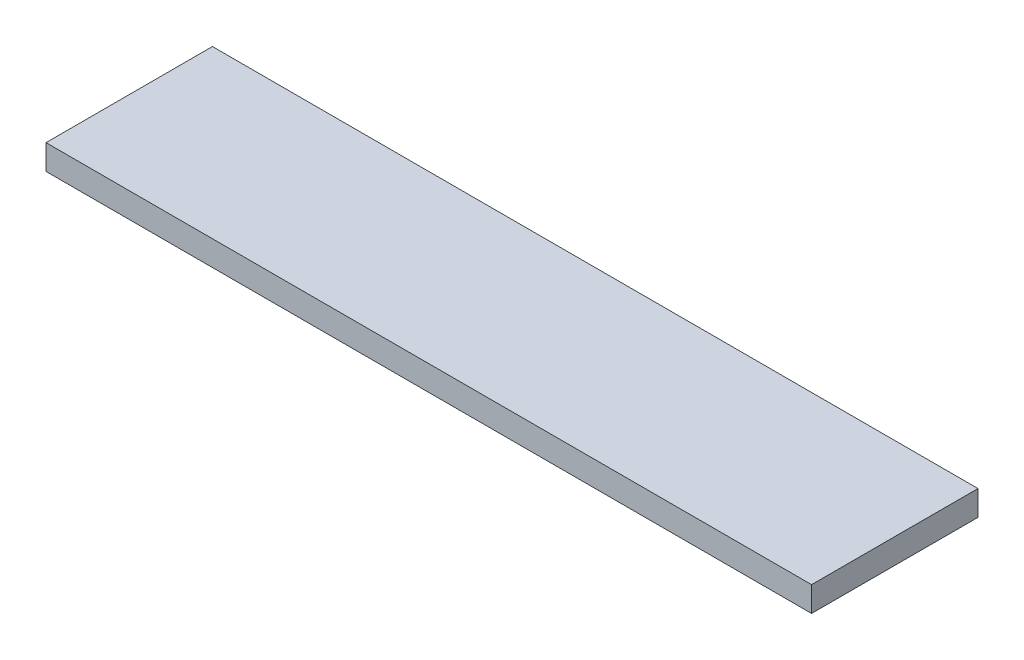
ISO-10303-21;
HEADER;
FILE_DESCRIPTION(('STEP AP214'),'2;1');
FILE_NAME('part.step','',(''),(''),'','','');
FILE_SCHEMA(('AUTOMOTIVE_DESIGN { 1 0 10303 214 1 1 1 1 }'));
ENDSEC;
DATA;
#1=APPLICATION_CONTEXT('core data for automotive mechanical design processes');
#2=APPLICATION_PROTOCOL_DEFINITION('international standard','automotive_design',2000,#1);
#3=PRODUCT_CONTEXT('',#1,'mechanical');
#4=PRODUCT('Part','Part','',(#3));
#5=PRODUCT_RELATED_PRODUCT_CATEGORY('part','',(#4));
#6=PRODUCT_DEFINITION_FORMATION('','',#4);
#7=PRODUCT_DEFINITION_CONTEXT('part definition',#1,'design');
#8=PRODUCT_DEFINITION('design','',#6,#7);
#9=PRODUCT_DEFINITION_SHAPE('','',#8);
#10=(LENGTH_UNIT() NAMED_UNIT(*) SI_UNIT(.MILLI.,.METRE.));
#11=(NAMED_UNIT(*) PLANE_ANGLE_UNIT() SI_UNIT($,.RADIAN.));
#12=(NAMED_UNIT(*) SI_UNIT($,.STERADIAN.) SOLID_ANGLE_UNIT());
#13=UNCERTAINTY_MEASURE_WITH_UNIT(LENGTH_MEASURE(1.E-05),#10,'distance_accuracy_value','');
#14=(GEOMETRIC_REPRESENTATION_CONTEXT(3) GLOBAL_UNCERTAINTY_ASSIGNED_CONTEXT((#13)) GLOBAL_UNIT_ASSIGNED_CONTEXT((#10,
#11,#12)) REPRESENTATION_CONTEXT('',''));
#15=CARTESIAN_POINT('',(0.,0.,0.));
#16=DIRECTION('',(0.,0.,1.));
#17=DIRECTION('',(1.,0.,0.));
#18=AXIS2_PLACEMENT_3D('',#15,#16,#17);
#19=CARTESIAN_POINT('',(41.5,-0.01,15.));
#20=DIRECTION('',(-1.,0.,0.));
#21=DIRECTION('',(0.,0.,1.));
#22=AXIS2_PLACEMENT_3D('',#19,#20,#21);
#23=PLANE('',#22);
#24=DIRECTION('',(0.,1.,0.));
#25=VECTOR('',#24,1.);
#26=CARTESIAN_POINT('',(41.5,-0.01,5.));
#27=LINE('',#26,#25);
#28=CARTESIAN_POINT('',(41.5,0.,5.));
#29=VERTEX_POINT('',#28);
#30=CARTESIAN_POINT('',(41.5,1.5,5.));
#31=VERTEX_POINT('',#30);
#32=EDGE_CURVE('E39',#29,#31,#27,.T.);
#33=ORIENTED_EDGE('',*,*,#32,.T.);
#34=DIRECTION('',(0.,0.,1.));
#35=VECTOR('',#34,1.);
#36=CARTESIAN_POINT('',(41.5,1.5,0.));
#37=LINE('',#36,#35);
#38=CARTESIAN_POINT('',(41.5,1.5,15.));
#39=VERTEX_POINT('',#38);
#40=EDGE_CURVE('E90',#31,#39,#37,.T.);
#41=ORIENTED_EDGE('',*,*,#40,.T.);
#42=DIRECTION('',(0.,1.,0.));
#43=VECTOR('',#42,1.);
#44=CARTESIAN_POINT('',(41.5,1.5,15.));
#45=LINE('',#44,#43);
#46=CARTESIAN_POINT('',(41.5,0.,15.));
#47=VERTEX_POINT('',#46);
#48=EDGE_CURVE('E89',#47,#39,#45,.T.);
#49=ORIENTED_EDGE('',*,*,#48,.F.);
#50=DIRECTION('',(0.,0.,1.));
#51=VECTOR('',#50,1.);
#52=CARTESIAN_POINT('',(41.5,0.,0.));
#53=LINE('',#52,#51);
#54=EDGE_CURVE('E52',#29,#47,#53,.T.);
#55=ORIENTED_EDGE('',*,*,#54,.F.);
#56=EDGE_LOOP('',(#33,#41,#49,#55));
#57=FACE_BOUND('',#56,.T.);
#58=ADVANCED_FACE('F35',(#57),#23,.F.);
#59=CARTESIAN_POINT('',(31.5,-0.01,5.));
#60=DIRECTION('',(0.,0.,1.));
#61=DIRECTION('',(1.,0.,0.));
#62=AXIS2_PLACEMENT_3D('',#59,#60,#61);
#63=PLANE('',#62);
#64=DIRECTION('',(1.,0.,0.));
#65=VECTOR('',#64,1.);
#66=CARTESIAN_POINT('',(0.,0.,5.));
#67=LINE('',#66,#65);
#68=CARTESIAN_POINT('',(-4.5,0.,5.));
#69=VERTEX_POINT('',#68);
#70=EDGE_CURVE('E101',#69,#29,#67,.T.);
#71=ORIENTED_EDGE('',*,*,#70,.F.);
#72=DIRECTION('',(0.,1.,0.));
#73=VECTOR('',#72,1.);
#74=CARTESIAN_POINT('',(-4.5,-0.01,5.));
#75=LINE('',#74,#73);
#76=CARTESIAN_POINT('',(-4.5,1.5,5.));
#77=VERTEX_POINT('',#76);
#78=EDGE_CURVE('E11',#69,#77,#75,.T.);
#79=ORIENTED_EDGE('',*,*,#78,.T.);
#80=DIRECTION('',(-1.,0.,0.));
#81=VECTOR('',#80,1.);
#82=CARTESIAN_POINT('',(0.,1.5,5.));
#83=LINE('',#82,#81);
#84=EDGE_CURVE('E97',#31,#77,#83,.T.);
#85=ORIENTED_EDGE('',*,*,#84,.F.);
#86=ORIENTED_EDGE('',*,*,#32,.F.);
#87=EDGE_LOOP('',(#71,#79,#85,#86));
#88=FACE_BOUND('',#87,.T.);
#89=ADVANCED_FACE('F109',(#88),#63,.F.);
#90=CARTESIAN_POINT('',(-4.5,-0.01,15.));
#91=DIRECTION('',(-1.,0.,0.));
#92=DIRECTION('',(0.,0.,1.));
#93=AXIS2_PLACEMENT_3D('',#90,#91,#92);
#94=PLANE('',#93);
#95=ORIENTED_EDGE('',*,*,#78,.F.);
#96=DIRECTION('',(0.,0.,1.));
#97=VECTOR('',#96,1.);
#98=CARTESIAN_POINT('',(-4.5,0.,0.));
#99=LINE('',#98,#97);
#100=CARTESIAN_POINT('',(-4.5,0.,15.));
#101=VERTEX_POINT('',#100);
#102=EDGE_CURVE('E81',#69,#101,#99,.T.);
#103=ORIENTED_EDGE('',*,*,#102,.T.);
#104=DIRECTION('',(0.,1.,0.));
#105=VECTOR('',#104,1.);
#106=CARTESIAN_POINT('',(-4.5,1.5,15.));
#107=LINE('',#106,#105);
#108=CARTESIAN_POINT('',(-4.5,1.5,15.));
#109=VERTEX_POINT('',#108);
#110=EDGE_CURVE('E87',#101,#109,#107,.T.);
#111=ORIENTED_EDGE('',*,*,#110,.T.);
#112=DIRECTION('',(0.,0.,1.));
#113=VECTOR('',#112,1.);
#114=CARTESIAN_POINT('',(-4.5,1.5,0.));
#115=LINE('',#114,#113);
#116=EDGE_CURVE('E60',#77,#109,#115,.T.);
#117=ORIENTED_EDGE('',*,*,#116,.F.);
#118=EDGE_LOOP('',(#95,#103,#111,#117));
#119=FACE_BOUND('',#118,.T.);
#120=ADVANCED_FACE('F92',(#119),#94,.T.);
#121=CARTESIAN_POINT('',(0.,1.5,15.));
#122=DIRECTION('',(0.,0.,-1.));
#123=DIRECTION('',(-1.,0.,0.));
#124=AXIS2_PLACEMENT_3D('',#121,#122,#123);
#125=PLANE('',#124);
#126=DIRECTION('',(1.,0.,0.));
#127=VECTOR('',#126,1.);
#128=CARTESIAN_POINT('',(0.,0.,15.));
#129=LINE('',#128,#127);
#130=EDGE_CURVE('E44',#101,#47,#129,.T.);
#131=ORIENTED_EDGE('',*,*,#130,.T.);
#132=ORIENTED_EDGE('',*,*,#48,.T.);
#133=DIRECTION('',(1.,0.,0.));
#134=VECTOR('',#133,1.);
#135=CARTESIAN_POINT('',(0.,1.5,15.));
#136=LINE('',#135,#134);
#137=EDGE_CURVE('E84',#109,#39,#136,.T.);
#138=ORIENTED_EDGE('',*,*,#137,.F.);
#139=ORIENTED_EDGE('',*,*,#110,.F.);
#140=EDGE_LOOP('',(#131,#132,#138,#139));
#141=FACE_BOUND('',#140,.T.);
#142=ADVANCED_FACE('F37',(#141),#125,.F.);
#143=CARTESIAN_POINT('',(0.,0.,0.));
#144=DIRECTION('',(0.,1.,0.));
#145=DIRECTION('',(0.,0.,1.));
#146=AXIS2_PLACEMENT_3D('',#143,#144,#145);
#147=PLANE('',#146);
#148=ORIENTED_EDGE('',*,*,#70,.T.);
#149=ORIENTED_EDGE('',*,*,#54,.T.);
#150=ORIENTED_EDGE('',*,*,#130,.F.);
#151=ORIENTED_EDGE('',*,*,#102,.F.);
#152=EDGE_LOOP('',(#148,#149,#150,#151));
#153=FACE_BOUND('',#152,.T.);
#154=ADVANCED_FACE('F79',(#153),#147,.F.);
#155=CARTESIAN_POINT('',(0.,1.5,0.));
#156=DIRECTION('',(0.,1.,0.));
#157=DIRECTION('',(0.,0.,1.));
#158=AXIS2_PLACEMENT_3D('',#155,#156,#157);
#159=PLANE('',#158);
#160=ORIENTED_EDGE('',*,*,#40,.F.);
#161=ORIENTED_EDGE('',*,*,#84,.T.);
#162=ORIENTED_EDGE('',*,*,#116,.T.);
#163=ORIENTED_EDGE('',*,*,#137,.T.);
#164=EDGE_LOOP('',(#160,#161,#162,#163));
#165=FACE_BOUND('',#164,.T.);
#166=ADVANCED_FACE('F107',(#165),#159,.T.);
#167=CLOSED_SHELL('',(#58,#89,#120,#142,#154,#166));
#168=MANIFOLD_SOLID_BREP('B2',#167);
#169=ADVANCED_BREP_SHAPE_REPRESENTATION('',(#18,#168),#14);
#170=SHAPE_DEFINITION_REPRESENTATION(#9,#169);
ENDSEC;
END-ISO-10303-21;
